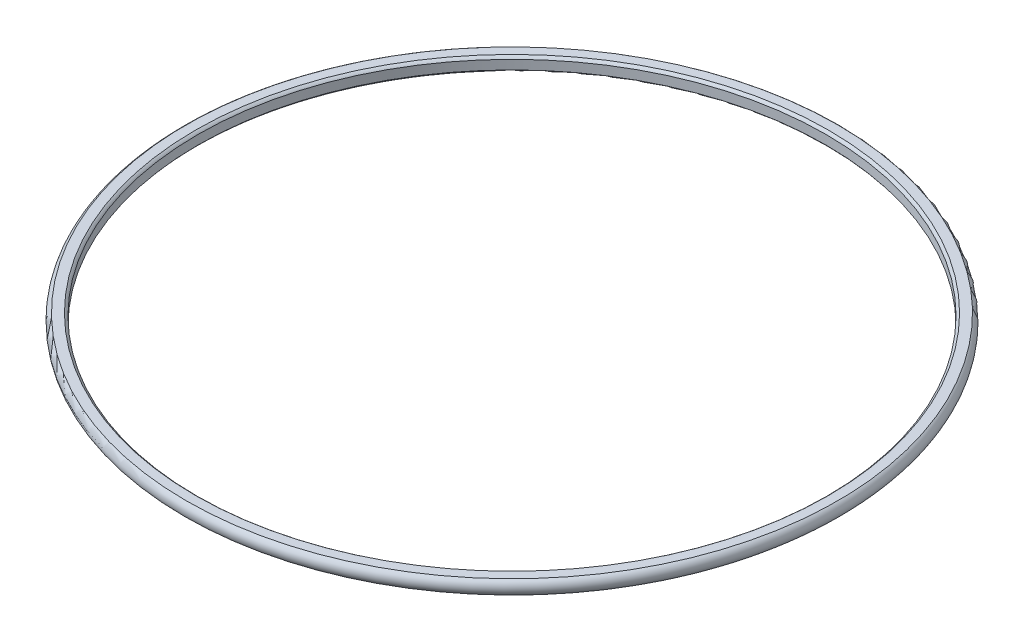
ISO-10303-21;
HEADER;
FILE_DESCRIPTION(('STEP AP214'),'2;1');
FILE_NAME('part.step','',(''),(''),'','','');
FILE_SCHEMA(('AUTOMOTIVE_DESIGN { 1 0 10303 214 1 1 1 1 }'));
ENDSEC;
DATA;
#1=APPLICATION_CONTEXT('core data for automotive mechanical design processes');
#2=APPLICATION_PROTOCOL_DEFINITION('international standard','automotive_design',2000,#1);
#3=PRODUCT_CONTEXT('',#1,'mechanical');
#4=PRODUCT('Part','Part','',(#3));
#5=PRODUCT_RELATED_PRODUCT_CATEGORY('part','',(#4));
#6=PRODUCT_DEFINITION_FORMATION('','',#4);
#7=PRODUCT_DEFINITION_CONTEXT('part definition',#1,'design');
#8=PRODUCT_DEFINITION('design','',#6,#7);
#9=PRODUCT_DEFINITION_SHAPE('','',#8);
#10=(LENGTH_UNIT() NAMED_UNIT(*) SI_UNIT(.MILLI.,.METRE.));
#11=(NAMED_UNIT(*) PLANE_ANGLE_UNIT() SI_UNIT($,.RADIAN.));
#12=(NAMED_UNIT(*) SI_UNIT($,.STERADIAN.) SOLID_ANGLE_UNIT());
#13=UNCERTAINTY_MEASURE_WITH_UNIT(LENGTH_MEASURE(1.E-05),#10,'distance_accuracy_value','');
#14=(GEOMETRIC_REPRESENTATION_CONTEXT(3) GLOBAL_UNCERTAINTY_ASSIGNED_CONTEXT((#13)) GLOBAL_UNIT_ASSIGNED_CONTEXT((#10,
#11,#12)) REPRESENTATION_CONTEXT('',''));
#15=CARTESIAN_POINT('',(0.,0.,0.));
#16=DIRECTION('',(0.,0.,1.));
#17=DIRECTION('',(1.,0.,0.));
#18=AXIS2_PLACEMENT_3D('',#15,#16,#17);
#19=CARTESIAN_POINT('',(0.,-0.75502525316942,0.));
#20=DIRECTION('',(0.,1.,0.));
#21=DIRECTION('',(0.,0.,1.));
#22=AXIS2_PLACEMENT_3D('',#19,#20,#21);
#23=TOROIDAL_SURFACE('',#22,34.2550252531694,0.9);
#24=CARTESIAN_POINT('',(0.,-0.265191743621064,0.));
#25=DIRECTION('',(0.,1.,0.));
#26=DIRECTION('',(0.,0.,1.));
#27=AXIS2_PLACEMENT_3D('',#24,#25,#26);
#28=CIRCLE('',#27,33.5);
#29=CARTESIAN_POINT('',(0.,-0.265191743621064,33.5));
#30=VERTEX_POINT('',#29);
#31=EDGE_CURVE('E10',#30,#30,#28,.T.);
#32=ORIENTED_EDGE('',*,*,#31,.F.);
#33=EDGE_LOOP('',(#32));
#34=FACE_BOUND('',#33,.T.);
#35=CARTESIAN_POINT('',(0.,0.,0.));
#36=DIRECTION('',(0.,1.,0.));
#37=DIRECTION('',(0.,0.,1.));
#38=AXIS2_PLACEMENT_3D('',#35,#36,#37);
#39=CIRCLE('',#38,33.7651917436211);
#40=CARTESIAN_POINT('',(0.,0.,33.7651917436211));
#41=VERTEX_POINT('',#40);
#42=EDGE_CURVE('E51',#41,#41,#39,.T.);
#43=ORIENTED_EDGE('',*,*,#42,.T.);
#44=EDGE_LOOP('',(#43));
#45=FACE_BOUND('',#44,.T.);
#46=ADVANCED_FACE('F37',(#34,#45),#23,.T.);
#47=CARTESIAN_POINT('',(0.,0.,0.));
#48=DIRECTION('',(0.,1.,0.));
#49=DIRECTION('',(0.,0.,1.));
#50=AXIS2_PLACEMENT_3D('',#47,#48,#49);
#51=CYLINDRICAL_SURFACE('',#50,33.5);
#52=CARTESIAN_POINT('',(0.,-1.24485876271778,0.));
#53=DIRECTION('',(0.,1.,0.));
#54=DIRECTION('',(0.,0.,1.));
#55=AXIS2_PLACEMENT_3D('',#52,#53,#54);
#56=CIRCLE('',#55,33.5);
#57=CARTESIAN_POINT('',(0.,-1.24485876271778,33.5));
#58=VERTEX_POINT('',#57);
#59=EDGE_CURVE('E43',#58,#58,#56,.T.);
#60=ORIENTED_EDGE('',*,*,#59,.F.);
#61=EDGE_LOOP('',(#60));
#62=FACE_BOUND('',#61,.T.);
#63=ORIENTED_EDGE('',*,*,#31,.T.);
#64=EDGE_LOOP('',(#63));
#65=FACE_BOUND('',#64,.T.);
#66=ADVANCED_FACE('F66',(#62,#65),#51,.F.);
#67=CARTESIAN_POINT('',(0.,-0.75502525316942,0.));
#68=DIRECTION('',(0.,1.,0.));
#69=DIRECTION('',(0.,0.,1.));
#70=AXIS2_PLACEMENT_3D('',#67,#68,#69);
#71=TOROIDAL_SURFACE('',#70,34.2550252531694,0.9);
#72=CARTESIAN_POINT('',(0.,0.,0.));
#73=DIRECTION('',(0.,1.,0.));
#74=DIRECTION('',(0.,0.,1.));
#75=AXIS2_PLACEMENT_3D('',#72,#73,#74);
#76=CIRCLE('',#75,34.7448587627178);
#77=CARTESIAN_POINT('',(0.,0.,34.7448587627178));
#78=VERTEX_POINT('',#77);
#79=EDGE_CURVE('E47',#78,#78,#76,.T.);
#80=ORIENTED_EDGE('',*,*,#79,.F.);
#81=EDGE_LOOP('',(#80));
#82=FACE_BOUND('',#81,.T.);
#83=ORIENTED_EDGE('',*,*,#59,.T.);
#84=EDGE_LOOP('',(#83));
#85=FACE_BOUND('',#84,.T.);
#86=ADVANCED_FACE('F61',(#82,#85),#71,.T.);
#87=CARTESIAN_POINT('',(33.7651917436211,0.,0.));
#88=DIRECTION('',(0.,-1.,0.));
#89=DIRECTION('',(0.,0.,-1.));
#90=AXIS2_PLACEMENT_3D('',#87,#88,#89);
#91=PLANE('',#90);
#92=ORIENTED_EDGE('',*,*,#42,.F.);
#93=EDGE_LOOP('',(#92));
#94=FACE_BOUND('',#93,.T.);
#95=ORIENTED_EDGE('',*,*,#79,.T.);
#96=EDGE_LOOP('',(#95));
#97=FACE_BOUND('',#96,.T.);
#98=ADVANCED_FACE('F58',(#94,#97),#91,.F.);
#99=CLOSED_SHELL('',(#46,#66,#86,#98));
#100=MANIFOLD_SOLID_BREP('B2',#99);
#101=ADVANCED_BREP_SHAPE_REPRESENTATION('',(#18,#100),#14);
#102=SHAPE_DEFINITION_REPRESENTATION(#9,#101);
ENDSEC;
END-ISO-10303-21;
